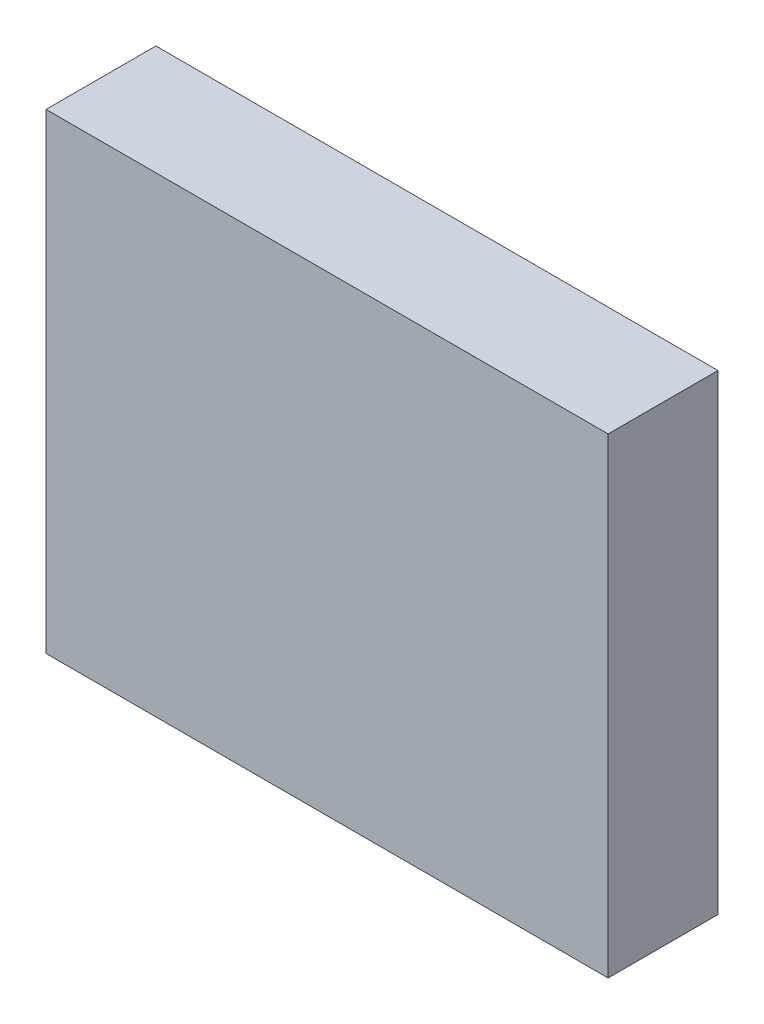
from build123d import *

# Parameters (mm, degrees)
SKIZZE1_W               = 102.351230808
SKIZZE1_H               = 85.799381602
LINEAR_AUSTRAGEN1_DEPTH = 20


with BuildPart() as part:
    # Skizze1 → Linear austragen1 (new body)
    with BuildSketch(Plane.XY):
        with Locations((346.523401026, -273.632650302)):
            Rectangle(SKIZZE1_W, SKIZZE1_H)
    extrude(amount=LINEAR_AUSTRAGEN1_DEPTH)


solid = part.part
